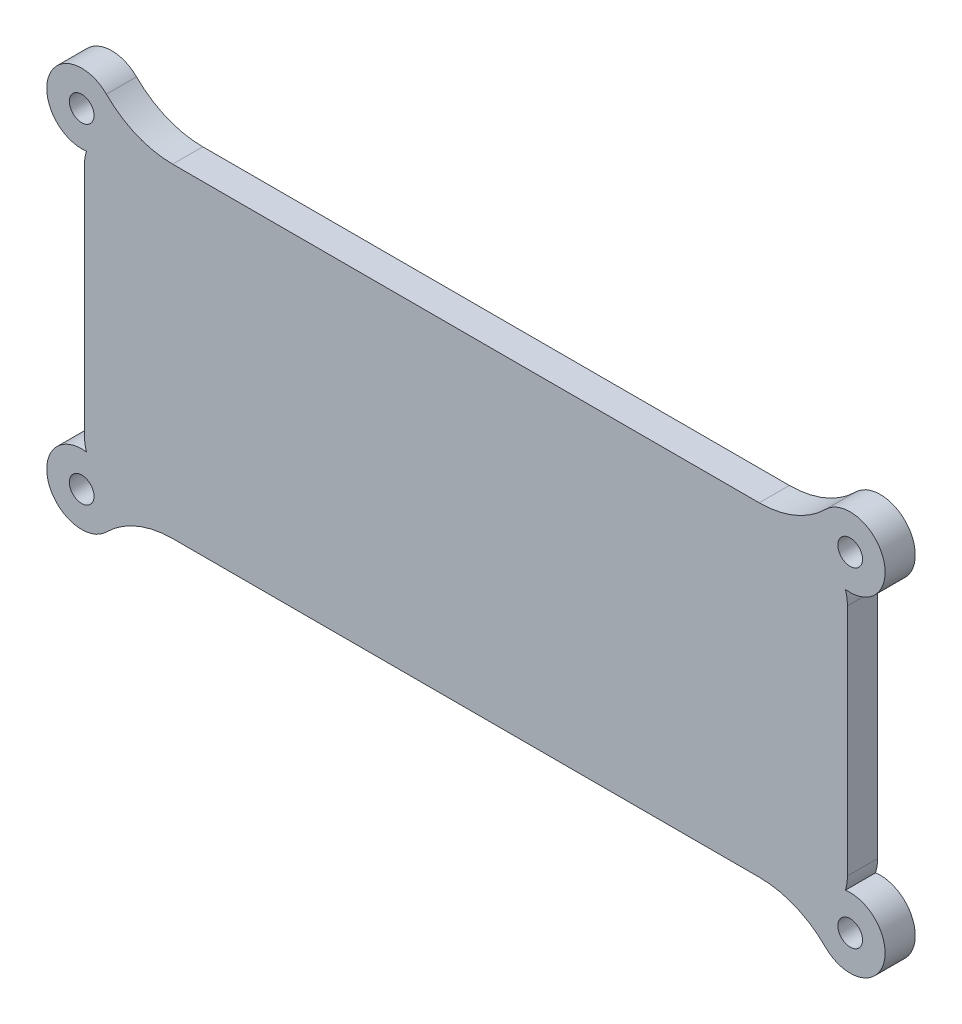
ISO-10303-21;
HEADER;
FILE_DESCRIPTION(('STEP AP214'),'2;1');
FILE_NAME('part.step','',(''),(''),'','','');
FILE_SCHEMA(('AUTOMOTIVE_DESIGN { 1 0 10303 214 1 1 1 1 }'));
ENDSEC;
DATA;
#1=APPLICATION_CONTEXT('core data for automotive mechanical design processes');
#2=APPLICATION_PROTOCOL_DEFINITION('international standard','automotive_design',2000,#1);
#3=PRODUCT_CONTEXT('',#1,'mechanical');
#4=PRODUCT('Part','Part','',(#3));
#5=PRODUCT_RELATED_PRODUCT_CATEGORY('part','',(#4));
#6=PRODUCT_DEFINITION_FORMATION('','',#4);
#7=PRODUCT_DEFINITION_CONTEXT('part definition',#1,'design');
#8=PRODUCT_DEFINITION('design','',#6,#7);
#9=PRODUCT_DEFINITION_SHAPE('','',#8);
#10=(LENGTH_UNIT() NAMED_UNIT(*) SI_UNIT(.MILLI.,.METRE.));
#11=(NAMED_UNIT(*) PLANE_ANGLE_UNIT() SI_UNIT($,.RADIAN.));
#12=(NAMED_UNIT(*) SI_UNIT($,.STERADIAN.) SOLID_ANGLE_UNIT());
#13=UNCERTAINTY_MEASURE_WITH_UNIT(LENGTH_MEASURE(1.E-05),#10,'distance_accuracy_value','');
#14=(GEOMETRIC_REPRESENTATION_CONTEXT(3) GLOBAL_UNCERTAINTY_ASSIGNED_CONTEXT((#13)) GLOBAL_UNIT_ASSIGNED_CONTEXT((#10,
#11,#12)) REPRESENTATION_CONTEXT('',''));
#15=CARTESIAN_POINT('',(0.,0.,0.));
#16=DIRECTION('',(0.,0.,1.));
#17=DIRECTION('',(1.,0.,0.));
#18=AXIS2_PLACEMENT_3D('',#15,#16,#17);
#19=CARTESIAN_POINT('',(-13.8053992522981,53.2126493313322,0.));
#20=DIRECTION('',(0.,0.,1.));
#21=DIRECTION('',(1.,0.,0.));
#22=AXIS2_PLACEMENT_3D('',#19,#20,#21);
#23=PLANE('',#22);
#24=CARTESIAN_POINT('',(-26.2752289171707,10.0580179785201,0.));
#25=DIRECTION('',(0.,0.,1.));
#26=DIRECTION('',(1.,0.,0.));
#27=AXIS2_PLACEMENT_3D('',#24,#25,#26);
#28=CIRCLE('',#27,4.5);
#29=CARTESIAN_POINT('',(-21.7752289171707,10.0580179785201,0.));
#30=VERTEX_POINT('',#29);
#31=EDGE_CURVE('E11',#30,#30,#28,.F.);
#32=ORIENTED_EDGE('',*,*,#31,.F.);
#33=EDGE_LOOP('',(#32));
#34=FACE_BOUND('',#33,.T.);
#35=CARTESIAN_POINT('',(-128.098699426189,37.8702484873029,0.));
#36=DIRECTION('',(0.,0.,1.));
#37=DIRECTION('',(1.,0.,0.));
#38=AXIS2_PLACEMENT_3D('',#35,#36,#37);
#39=CIRCLE('',#38,2.08280000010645);
#40=CARTESIAN_POINT('',(-126.015899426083,37.8702484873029,0.));
#41=VERTEX_POINT('',#40);
#42=EDGE_CURVE('E238',#41,#41,#39,.T.);
#43=ORIENTED_EDGE('',*,*,#42,.T.);
#44=EDGE_LOOP('',(#43));
#45=FACE_BOUND('',#44,.T.);
#46=CARTESIAN_POINT('',(-128.098699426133,-17.7542125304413,0.));
#47=DIRECTION('',(0.,0.,1.));
#48=DIRECTION('',(1.,0.,0.));
#49=AXIS2_PLACEMENT_3D('',#46,#47,#48);
#50=CIRCLE('',#49,2.08279999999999);
#51=CARTESIAN_POINT('',(-126.015899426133,-17.7542125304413,0.));
#52=VERTEX_POINT('',#51);
#53=EDGE_CURVE('E248',#52,#52,#50,.T.);
#54=ORIENTED_EDGE('',*,*,#53,.T.);
#55=EDGE_LOOP('',(#54));
#56=FACE_BOUND('',#55,.T.);
#57=CARTESIAN_POINT('',(1.53700159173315,37.8702484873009,0.));
#58=DIRECTION('',(0.,0.,1.));
#59=DIRECTION('',(1.,0.,0.));
#60=AXIS2_PLACEMENT_3D('',#57,#58,#59);
#61=CIRCLE('',#60,2.08280000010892);
#62=CARTESIAN_POINT('',(3.61980159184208,37.8702484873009,0.));
#63=VERTEX_POINT('',#62);
#64=EDGE_CURVE('E253',#63,#63,#61,.T.);
#65=ORIENTED_EDGE('',*,*,#64,.T.);
#66=EDGE_LOOP('',(#65));
#67=FACE_BOUND('',#66,.T.);
#68=CARTESIAN_POINT('',(1.53700159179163,-17.7542125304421,0.));
#69=DIRECTION('',(0.,0.,1.));
#70=DIRECTION('',(1.,0.,0.));
#71=AXIS2_PLACEMENT_3D('',#68,#69,#70);
#72=CIRCLE('',#71,2.08279999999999);
#73=CARTESIAN_POINT('',(3.61980159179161,-17.7542125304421,0.));
#74=VERTEX_POINT('',#73);
#75=EDGE_CURVE('E259',#74,#74,#72,.T.);
#76=ORIENTED_EDGE('',*,*,#75,.T.);
#77=EDGE_LOOP('',(#76));
#78=FACE_BOUND('',#77,.T.);
#79=CARTESIAN_POINT('',(-13.8053992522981,53.2126493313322,0.));
#80=DIRECTION('',(0.,0.,-1.));
#81=DIRECTION('',(1.,0.,0.));
#82=AXIS2_PLACEMENT_3D('',#79,#80,#81);
#83=CIRCLE('',#82,15.8046313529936);
#84=CARTESIAN_POINT('',(-2.62983724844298,42.037087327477,0.));
#85=VERTEX_POINT('',#84);
#86=CARTESIAN_POINT('',(-13.8053992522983,37.4080179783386,0.));
#87=VERTEX_POINT('',#86);
#88=EDGE_CURVE('E265',#85,#87,#83,.T.);
#89=ORIENTED_EDGE('',*,*,#88,.F.);
#90=CARTESIAN_POINT('',(1.53700159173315,37.8702484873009,0.));
#91=DIRECTION('',(0.,0.,1.));
#92=DIRECTION('',(1.,0.,0.));
#93=AXIS2_PLACEMENT_3D('',#90,#91,#92);
#94=CIRCLE('',#93,5.89280000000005);
#95=CARTESIAN_POINT('',(0.736925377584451,32.03201503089,0.));
#96=VERTEX_POINT('',#95);
#97=EDGE_CURVE('E272',#96,#85,#94,.T.);
#98=ORIENTED_EDGE('',*,*,#97,.F.);
#99=CARTESIAN_POINT('',(1.07477108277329,29.7880179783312,0.));
#100=CARTESIAN_POINT('',(1.07476896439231,30.8298968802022,0.));
#101=CARTESIAN_POINT('',(0.794869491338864,31.8343376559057,0.));
#102=CARTESIAN_POINT('',(0.767178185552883,31.9337100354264,0.));
#103=CARTESIAN_POINT('',(0.736925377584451,32.03201503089,0.));
#104=B_SPLINE_CURVE_WITH_KNOTS('',2,(#99,#100,#101,#102,#103),.UNSPECIFIED.,.F.,.F.,(3,2,3),(0.,
0.25,0.275715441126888),.UNSPECIFIED.);
#105=CARTESIAN_POINT('',(1.07477108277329,29.7880179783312,0.));
#106=VERTEX_POINT('',#105);
#107=EDGE_CURVE('E632',#106,#96,#104,.T.);
#108=ORIENTED_EDGE('',*,*,#107,.F.);
#109=DIRECTION('',(0.,1.,0.));
#110=VECTOR('',#109,1.);
#111=CARTESIAN_POINT('',(1.07477108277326,-9.67198202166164,0.));
#112=LINE('',#111,#110);
#113=CARTESIAN_POINT('',(1.07477108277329,-9.67198202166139,0.));
#114=VERTEX_POINT('',#113);
#115=EDGE_CURVE('E473',#114,#106,#112,.T.);
#116=ORIENTED_EDGE('',*,*,#115,.F.);
#117=CARTESIAN_POINT('',(0.736871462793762,-11.915986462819,0.));
#118=CARTESIAN_POINT('',(0.824350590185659,-11.6321245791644,0.));
#119=CARTESIAN_POINT('',(1.00171403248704,-10.9098310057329,0.));
#120=CARTESIAN_POINT('',(1.07477068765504,-10.145005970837,0.));
#121=CARTESIAN_POINT('',(1.07477108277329,-9.67198202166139,0.));
#122=B_SPLINE_CURVE_WITH_KNOTS('',3,(#117,#118,#119,#120,#121),.UNSPECIFIED.,.F.,.F.,(4,1,4),
(0.0113006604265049,0.015257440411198,0.0211260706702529),.UNSPECIFIED.);
#123=CARTESIAN_POINT('',(0.736871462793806,-11.9159864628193,0.));
#124=VERTEX_POINT('',#123);
#125=EDGE_CURVE('E466',#124,#114,#122,.T.);
#126=ORIENTED_EDGE('',*,*,#125,.F.);
#127=CARTESIAN_POINT('',(1.53700159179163,-17.7542125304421,0.));
#128=DIRECTION('',(0.,0.,1.));
#129=DIRECTION('',(1.,0.,0.));
#130=AXIS2_PLACEMENT_3D('',#127,#128,#129);
#131=CIRCLE('',#130,5.89280000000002);
#132=CARTESIAN_POINT('',(-2.62983724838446,-21.9210513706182,0.));
#133=VERTEX_POINT('',#132);
#134=EDGE_CURVE('E465',#133,#124,#131,.T.);
#135=ORIENTED_EDGE('',*,*,#134,.F.);
#136=CARTESIAN_POINT('',(-13.8053992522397,-33.0966133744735,0.));
#137=DIRECTION('',(0.,0.,-1.));
#138=DIRECTION('',(1.,0.,0.));
#139=AXIS2_PLACEMENT_3D('',#136,#137,#138);
#140=CIRCLE('',#139,15.8046313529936);
#141=CARTESIAN_POINT('',(-13.8053992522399,-17.2919820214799,0.));
#142=VERTEX_POINT('',#141);
#143=EDGE_CURVE('E467',#142,#133,#140,.T.);
#144=ORIENTED_EDGE('',*,*,#143,.F.);
#145=DIRECTION('',(1.,0.,0.));
#146=VECTOR('',#145,1.);
#147=CARTESIAN_POINT('',(-112.756298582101,-17.2919820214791,0.));
#148=LINE('',#147,#146);
#149=CARTESIAN_POINT('',(-112.756298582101,-17.2919820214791,0.));
#150=VERTEX_POINT('',#149);
#151=EDGE_CURVE('E474',#150,#142,#148,.T.);
#152=ORIENTED_EDGE('',*,*,#151,.F.);
#153=CARTESIAN_POINT('',(-112.756298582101,-33.0966133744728,0.));
#154=DIRECTION('',(0.,0.,-1.));
#155=DIRECTION('',(1.,0.,0.));
#156=AXIS2_PLACEMENT_3D('',#153,#154,#155);
#157=CIRCLE('',#156,15.8046313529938);
#158=CARTESIAN_POINT('',(-123.931860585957,-21.9210513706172,0.));
#159=VERTEX_POINT('',#158);
#160=EDGE_CURVE('E374',#159,#150,#157,.T.);
#161=ORIENTED_EDGE('',*,*,#160,.F.);
#162=CARTESIAN_POINT('',(-128.098699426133,-17.7542125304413,0.));
#163=DIRECTION('',(0.,0.,1.));
#164=DIRECTION('',(1.,0.,0.));
#165=AXIS2_PLACEMENT_3D('',#162,#163,#164);
#166=CIRCLE('',#165,5.89279999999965);
#167=CARTESIAN_POINT('',(-127.298623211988,-11.9159790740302,0.));
#168=VERTEX_POINT('',#167);
#169=EDGE_CURVE('E372',#168,#159,#166,.T.);
#170=ORIENTED_EDGE('',*,*,#169,.F.);
#171=CARTESIAN_POINT('',(-127.636468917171,-9.67198202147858,0.));
#172=CARTESIAN_POINT('',(-127.636466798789,-10.713860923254,0.));
#173=CARTESIAN_POINT('',(-127.356567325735,-11.7183016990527,0.));
#174=CARTESIAN_POINT('',(-127.328876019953,-11.8176740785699,0.));
#175=CARTESIAN_POINT('',(-127.298623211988,-11.9159790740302,0.));
#176=B_SPLINE_CURVE_WITH_KNOTS('',2,(#171,#172,#173,#174,#175),.UNSPECIFIED.,.F.,.F.,(3,2,3),
(0.,0.25,0.275715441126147),.UNSPECIFIED.);
#177=CARTESIAN_POINT('',(-127.636468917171,-9.67198202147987,0.));
#178=VERTEX_POINT('',#177);
#179=EDGE_CURVE('E369',#178,#168,#176,.T.);
#180=ORIENTED_EDGE('',*,*,#179,.F.);
#181=DIRECTION('',(0.,-1.,0.));
#182=VECTOR('',#181,1.);
#183=CARTESIAN_POINT('',(-127.636468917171,-9.67198202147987,0.));
#184=LINE('',#183,#182);
#185=CARTESIAN_POINT('',(-127.636468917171,29.78801797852,0.));
#186=VERTEX_POINT('',#185);
#187=EDGE_CURVE('E362',#186,#178,#184,.T.);
#188=ORIENTED_EDGE('',*,*,#187,.F.);
#189=CARTESIAN_POINT('',(-127.298569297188,32.0320224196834,0.));
#190=CARTESIAN_POINT('',(-127.386048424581,31.7481605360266,0.));
#191=CARTESIAN_POINT('',(-127.563411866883,31.0258669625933,0.));
#192=CARTESIAN_POINT('',(-127.636468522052,30.2610419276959,0.));
#193=CARTESIAN_POINT('',(-127.636468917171,29.78801797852,0.));
#194=B_SPLINE_CURVE_WITH_KNOTS('',3,(#189,#190,#191,#192,#193),.UNSPECIFIED.,.F.,.F.,(4,1,4),
(0.511300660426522,0.515257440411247,0.521126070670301),.UNSPECIFIED.);
#195=CARTESIAN_POINT('',(-127.298569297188,32.0320224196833,0.));
#196=VERTEX_POINT('',#195);
#197=EDGE_CURVE('E321',#196,#186,#194,.T.);
#198=ORIENTED_EDGE('',*,*,#197,.F.);
#199=CARTESIAN_POINT('',(-128.098699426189,37.8702484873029,0.));
#200=DIRECTION('',(0.,0.,1.));
#201=DIRECTION('',(1.,0.,0.));
#202=AXIS2_PLACEMENT_3D('',#199,#200,#201);
#203=CIRCLE('',#202,5.89279999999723);
#204=CARTESIAN_POINT('',(-123.931860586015,42.037087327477,0.));
#205=VERTEX_POINT('',#204);
#206=EDGE_CURVE('E326',#205,#196,#203,.T.);
#207=ORIENTED_EDGE('',*,*,#206,.F.);
#208=CARTESIAN_POINT('',(-112.75629858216,53.2126493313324,0.));
#209=DIRECTION('',(0.,0.,-1.));
#210=DIRECTION('',(1.,0.,0.));
#211=AXIS2_PLACEMENT_3D('',#208,#209,#210);
#212=CIRCLE('',#211,15.8046313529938);
#213=CARTESIAN_POINT('',(-112.75629858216,37.4080179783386,0.));
#214=VERTEX_POINT('',#213);
#215=EDGE_CURVE('E554',#214,#205,#212,.T.);
#216=ORIENTED_EDGE('',*,*,#215,.F.);
#217=DIRECTION('',(-1.,0.,0.));
#218=VECTOR('',#217,1.);
#219=CARTESIAN_POINT('',(-13.8053992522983,37.4080179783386,0.));
#220=LINE('',#219,#218);
#221=EDGE_CURVE('E552',#87,#214,#220,.T.);
#222=ORIENTED_EDGE('',*,*,#221,.F.);
#223=EDGE_LOOP('',(#89,#98,#108,#116,#126,#135,#144,#152,#161,#170,#180,#188,#198,#207,#216,#222));
#224=FACE_BOUND('',#223,.T.);
#225=DIRECTION('',(-1.,0.,0.));
#226=VECTOR('',#225,1.);
#227=CARTESIAN_POINT('',(-53.6252289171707,15.1380179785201,0.));
#228=LINE('',#227,#226);
#229=CARTESIAN_POINT('',(-53.6252289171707,15.1380179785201,0.));
#230=VERTEX_POINT('',#229);
#231=CARTESIAN_POINT('',(-54.8952289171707,15.1380179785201,0.));
#232=VERTEX_POINT('',#231);
#233=EDGE_CURVE('E237',#230,#232,#228,.T.);
#234=ORIENTED_EDGE('',*,*,#233,.F.);
#235=DIRECTION('',(0.,-1.,0.));
#236=VECTOR('',#235,1.);
#237=CARTESIAN_POINT('',(-53.6252289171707,15.1380179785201,0.));
#238=LINE('',#237,#236);
#239=CARTESIAN_POINT('',(-53.6252289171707,31.0580179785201,0.));
#240=VERTEX_POINT('',#239);
#241=EDGE_CURVE('E234',#240,#230,#238,.T.);
#242=ORIENTED_EDGE('',*,*,#241,.F.);
#243=DIRECTION('',(1.,0.,0.));
#244=VECTOR('',#243,1.);
#245=CARTESIAN_POINT('',(-53.6252289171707,31.0580179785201,0.));
#246=LINE('',#245,#244);
#247=CARTESIAN_POINT('',(-121.286468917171,31.0580179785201,0.));
#248=VERTEX_POINT('',#247);
#249=EDGE_CURVE('E1042',#248,#240,#246,.T.);
#250=ORIENTED_EDGE('',*,*,#249,.F.);
#251=DIRECTION('',(0.,1.,0.));
#252=VECTOR('',#251,1.);
#253=CARTESIAN_POINT('',(-121.286468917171,31.0580179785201,0.));
#254=LINE('',#253,#252);
#255=CARTESIAN_POINT('',(-121.286468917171,-10.9419820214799,0.));
#256=VERTEX_POINT('',#255);
#257=EDGE_CURVE('E1039',#256,#248,#254,.T.);
#258=ORIENTED_EDGE('',*,*,#257,.F.);
#259=DIRECTION('',(-1.,0.,0.));
#260=VECTOR('',#259,1.);
#261=CARTESIAN_POINT('',(-121.286468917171,-10.9419820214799,0.));
#262=LINE('',#261,#260);
#263=CARTESIAN_POINT('',(-53.6252289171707,-10.9419820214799,0.));
#264=VERTEX_POINT('',#263);
#265=EDGE_CURVE('E1036',#264,#256,#262,.T.);
#266=ORIENTED_EDGE('',*,*,#265,.F.);
#267=DIRECTION('',(0.,-1.,0.));
#268=VECTOR('',#267,1.);
#269=CARTESIAN_POINT('',(-53.6252289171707,-10.9419820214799,0.));
#270=LINE('',#269,#268);
#271=CARTESIAN_POINT('',(-53.6252289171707,4.97801797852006,0.));
#272=VERTEX_POINT('',#271);
#273=EDGE_CURVE('E1033',#272,#264,#270,.T.);
#274=ORIENTED_EDGE('',*,*,#273,.F.);
#275=DIRECTION('',(1.,0.,0.));
#276=VECTOR('',#275,1.);
#277=CARTESIAN_POINT('',(-53.6252289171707,4.97801797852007,0.));
#278=LINE('',#277,#276);
#279=CARTESIAN_POINT('',(-54.8952289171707,4.97801797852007,0.));
#280=VERTEX_POINT('',#279);
#281=EDGE_CURVE('E1030',#280,#272,#278,.T.);
#282=ORIENTED_EDGE('',*,*,#281,.F.);
#283=DIRECTION('',(0.,1.,0.));
#284=VECTOR('',#283,1.);
#285=CARTESIAN_POINT('',(-54.8952289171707,-9.67198202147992,0.));
#286=LINE('',#285,#284);
#287=CARTESIAN_POINT('',(-54.8952289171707,-9.67198202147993,0.));
#288=VERTEX_POINT('',#287);
#289=EDGE_CURVE('E1027',#288,#280,#286,.T.);
#290=ORIENTED_EDGE('',*,*,#289,.F.);
#291=DIRECTION('',(1.,0.,0.));
#292=VECTOR('',#291,1.);
#293=CARTESIAN_POINT('',(-120.016468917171,-9.67198202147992,0.));
#294=LINE('',#293,#292);
#295=CARTESIAN_POINT('',(-120.016468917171,-9.67198202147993,0.));
#296=VERTEX_POINT('',#295);
#297=EDGE_CURVE('E1024',#296,#288,#294,.T.);
#298=ORIENTED_EDGE('',*,*,#297,.F.);
#299=DIRECTION('',(0.,-1.,0.));
#300=VECTOR('',#299,1.);
#301=CARTESIAN_POINT('',(-120.016468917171,29.7880179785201,0.));
#302=LINE('',#301,#300);
#303=CARTESIAN_POINT('',(-120.016468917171,29.7880179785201,0.));
#304=VERTEX_POINT('',#303);
#305=EDGE_CURVE('E1021',#304,#296,#302,.T.);
#306=ORIENTED_EDGE('',*,*,#305,.F.);
#307=DIRECTION('',(-1.,0.,0.));
#308=VECTOR('',#307,1.);
#309=CARTESIAN_POINT('',(-54.8952289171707,29.7880179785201,0.));
#310=LINE('',#309,#308);
#311=CARTESIAN_POINT('',(-54.8952289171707,29.7880179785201,0.));
#312=VERTEX_POINT('',#311);
#313=EDGE_CURVE('E52',#312,#304,#310,.T.);
#314=ORIENTED_EDGE('',*,*,#313,.F.);
#315=DIRECTION('',(0.,1.,0.));
#316=VECTOR('',#315,1.);
#317=CARTESIAN_POINT('',(-54.8952289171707,15.1380179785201,0.));
#318=LINE('',#317,#316);
#319=EDGE_CURVE('E47',#232,#312,#318,.T.);
#320=ORIENTED_EDGE('',*,*,#319,.F.);
#321=EDGE_LOOP('',(#234,#242,#250,#258,#266,#274,#282,#290,#298,#306,#314,#320));
#322=FACE_BOUND('',#321,.T.);
#323=ADVANCED_FACE('F32',(#34,#45,#56,#67,#78,#224,#322),#23,.F.);
#324=CARTESIAN_POINT('',(-13.8053992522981,53.2126493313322,5.08));
#325=DIRECTION('',(0.,0.,1.));
#326=DIRECTION('',(1.,0.,0.));
#327=AXIS2_PLACEMENT_3D('',#324,#325,#326);
#328=PLANE('',#327);
#329=CARTESIAN_POINT('',(-128.098699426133,-17.7542125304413,5.08));
#330=DIRECTION('',(0.,0.,1.));
#331=DIRECTION('',(1.,0.,0.));
#332=AXIS2_PLACEMENT_3D('',#329,#330,#331);
#333=CIRCLE('',#332,2.08279999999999);
#334=CARTESIAN_POINT('',(-126.015899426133,-17.7542125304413,5.08));
#335=VERTEX_POINT('',#334);
#336=EDGE_CURVE('E250',#335,#335,#333,.T.);
#337=ORIENTED_EDGE('',*,*,#336,.F.);
#338=EDGE_LOOP('',(#337));
#339=FACE_BOUND('',#338,.T.);
#340=CARTESIAN_POINT('',(1.53700159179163,-17.7542125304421,5.08));
#341=DIRECTION('',(0.,0.,1.));
#342=DIRECTION('',(1.,0.,0.));
#343=AXIS2_PLACEMENT_3D('',#340,#341,#342);
#344=CIRCLE('',#343,2.08279999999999);
#345=CARTESIAN_POINT('',(3.61980159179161,-17.7542125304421,5.08));
#346=VERTEX_POINT('',#345);
#347=EDGE_CURVE('E262',#346,#346,#344,.T.);
#348=ORIENTED_EDGE('',*,*,#347,.F.);
#349=EDGE_LOOP('',(#348));
#350=FACE_BOUND('',#349,.T.);
#351=CARTESIAN_POINT('',(-13.8053992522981,53.2126493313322,5.08));
#352=DIRECTION('',(0.,0.,-1.));
#353=DIRECTION('',(1.,0.,0.));
#354=AXIS2_PLACEMENT_3D('',#351,#352,#353);
#355=CIRCLE('',#354,15.8046313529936);
#356=CARTESIAN_POINT('',(-2.62983724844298,42.037087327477,5.08));
#357=VERTEX_POINT('',#356);
#358=CARTESIAN_POINT('',(-13.8053992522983,37.4080179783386,5.08));
#359=VERTEX_POINT('',#358);
#360=EDGE_CURVE('E268',#357,#359,#355,.T.);
#361=ORIENTED_EDGE('',*,*,#360,.T.);
#362=DIRECTION('',(-1.,0.,0.));
#363=VECTOR('',#362,1.);
#364=CARTESIAN_POINT('',(-13.8053992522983,37.4080179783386,5.08));
#365=LINE('',#364,#363);
#366=CARTESIAN_POINT('',(-112.75629858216,37.4080179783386,5.08));
#367=VERTEX_POINT('',#366);
#368=EDGE_CURVE('E271',#359,#367,#365,.T.);
#369=ORIENTED_EDGE('',*,*,#368,.T.);
#370=CARTESIAN_POINT('',(-112.75629858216,53.2126493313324,5.08));
#371=DIRECTION('',(0.,0.,-1.));
#372=DIRECTION('',(1.,0.,0.));
#373=AXIS2_PLACEMENT_3D('',#370,#371,#372);
#374=CIRCLE('',#373,15.8046313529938);
#375=CARTESIAN_POINT('',(-123.931860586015,42.037087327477,5.08));
#376=VERTEX_POINT('',#375);
#377=EDGE_CURVE('E274',#367,#376,#374,.T.);
#378=ORIENTED_EDGE('',*,*,#377,.T.);
#379=CARTESIAN_POINT('',(-128.098699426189,37.8702484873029,5.08));
#380=DIRECTION('',(0.,0.,1.));
#381=DIRECTION('',(1.,0.,0.));
#382=AXIS2_PLACEMENT_3D('',#379,#380,#381);
#383=CIRCLE('',#382,5.89279999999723);
#384=CARTESIAN_POINT('',(-127.298569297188,32.0320224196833,5.08));
#385=VERTEX_POINT('',#384);
#386=EDGE_CURVE('E276',#376,#385,#383,.T.);
#387=ORIENTED_EDGE('',*,*,#386,.T.);
#388=CARTESIAN_POINT('',(-127.636468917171,29.78801797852,5.08));
#389=CARTESIAN_POINT('',(-127.636468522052,30.2610419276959,5.08));
#390=CARTESIAN_POINT('',(-127.563411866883,31.0258669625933,5.08));
#391=CARTESIAN_POINT('',(-127.386048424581,31.7481605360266,5.08));
#392=CARTESIAN_POINT('',(-127.298569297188,32.0320224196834,5.08));
#393=B_SPLINE_CURVE_WITH_KNOTS('',3,(#388,#389,#390,#391,#392),.UNSPECIFIED.,.F.,.F.,(4,1,4),
(0.511300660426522,0.517169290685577,0.521126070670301),.UNSPECIFIED.);
#394=CARTESIAN_POINT('',(-127.636468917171,29.78801797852,5.08));
#395=VERTEX_POINT('',#394);
#396=EDGE_CURVE('E380',#385,#395,#393,.F.);
#397=ORIENTED_EDGE('',*,*,#396,.T.);
#398=DIRECTION('',(0.,-1.,0.));
#399=VECTOR('',#398,1.);
#400=CARTESIAN_POINT('',(-127.636468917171,-9.67198202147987,5.08));
#401=LINE('',#400,#399);
#402=CARTESIAN_POINT('',(-127.636468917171,-9.67198202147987,5.08));
#403=VERTEX_POINT('',#402);
#404=EDGE_CURVE('E395',#395,#403,#401,.T.);
#405=ORIENTED_EDGE('',*,*,#404,.T.);
#406=CARTESIAN_POINT('',(-127.298623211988,-11.9159790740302,5.08));
#407=CARTESIAN_POINT('',(-127.328876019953,-11.8176740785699,5.08));
#408=CARTESIAN_POINT('',(-127.356567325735,-11.7183016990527,5.08));
#409=CARTESIAN_POINT('',(-127.636466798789,-10.713860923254,5.08));
#410=CARTESIAN_POINT('',(-127.636468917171,-9.67198202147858,5.08));
#411=B_SPLINE_CURVE_WITH_KNOTS('',2,(#406,#407,#408,#409,#410),.UNSPECIFIED.,.F.,.F.,(3,2,3),
(0.,0.0257154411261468,0.275715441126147),.UNSPECIFIED.);
#412=CARTESIAN_POINT('',(-127.298623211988,-11.9159790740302,5.08));
#413=VERTEX_POINT('',#412);
#414=EDGE_CURVE('E396',#403,#413,#411,.F.);
#415=ORIENTED_EDGE('',*,*,#414,.T.);
#416=CARTESIAN_POINT('',(-128.098699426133,-17.7542125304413,5.08));
#417=DIRECTION('',(0.,0.,1.));
#418=DIRECTION('',(1.,0.,0.));
#419=AXIS2_PLACEMENT_3D('',#416,#417,#418);
#420=CIRCLE('',#419,5.89279999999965);
#421=CARTESIAN_POINT('',(-123.931860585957,-21.9210513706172,5.08));
#422=VERTEX_POINT('',#421);
#423=EDGE_CURVE('E425',#413,#422,#420,.T.);
#424=ORIENTED_EDGE('',*,*,#423,.T.);
#425=CARTESIAN_POINT('',(-112.756298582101,-33.0966133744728,5.08));
#426=DIRECTION('',(0.,0.,-1.));
#427=DIRECTION('',(1.,0.,0.));
#428=AXIS2_PLACEMENT_3D('',#425,#426,#427);
#429=CIRCLE('',#428,15.8046313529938);
#430=CARTESIAN_POINT('',(-112.756298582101,-17.2919820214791,5.08));
#431=VERTEX_POINT('',#430);
#432=EDGE_CURVE('E427',#422,#431,#429,.T.);
#433=ORIENTED_EDGE('',*,*,#432,.T.);
#434=DIRECTION('',(1.,0.,0.));
#435=VECTOR('',#434,1.);
#436=CARTESIAN_POINT('',(-112.756298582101,-17.2919820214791,5.08));
#437=LINE('',#436,#435);
#438=CARTESIAN_POINT('',(-13.8053992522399,-17.2919820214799,5.08));
#439=VERTEX_POINT('',#438);
#440=EDGE_CURVE('E567',#431,#439,#437,.T.);
#441=ORIENTED_EDGE('',*,*,#440,.T.);
#442=CARTESIAN_POINT('',(-13.8053992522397,-33.0966133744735,5.08));
#443=DIRECTION('',(0.,0.,-1.));
#444=DIRECTION('',(1.,0.,0.));
#445=AXIS2_PLACEMENT_3D('',#442,#443,#444);
#446=CIRCLE('',#445,15.8046313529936);
#447=CARTESIAN_POINT('',(-2.62983724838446,-21.9210513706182,5.08));
#448=VERTEX_POINT('',#447);
#449=EDGE_CURVE('E607',#439,#448,#446,.T.);
#450=ORIENTED_EDGE('',*,*,#449,.T.);
#451=CARTESIAN_POINT('',(1.53700159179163,-17.7542125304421,5.08));
#452=DIRECTION('',(0.,0.,1.));
#453=DIRECTION('',(1.,0.,0.));
#454=AXIS2_PLACEMENT_3D('',#451,#452,#453);
#455=CIRCLE('',#454,5.89280000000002);
#456=CARTESIAN_POINT('',(0.736871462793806,-11.9159864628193,5.08));
#457=VERTEX_POINT('',#456);
#458=EDGE_CURVE('E599',#448,#457,#455,.T.);
#459=ORIENTED_EDGE('',*,*,#458,.T.);
#460=CARTESIAN_POINT('',(1.07477108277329,-9.67198202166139,5.08));
#461=CARTESIAN_POINT('',(1.07477068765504,-10.145005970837,5.08));
#462=CARTESIAN_POINT('',(1.00171403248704,-10.9098310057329,5.08));
#463=CARTESIAN_POINT('',(0.824350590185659,-11.6321245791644,5.08));
#464=CARTESIAN_POINT('',(0.736871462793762,-11.915986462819,5.08));
#465=B_SPLINE_CURVE_WITH_KNOTS('',3,(#460,#461,#462,#463,#464),.UNSPECIFIED.,.F.,.F.,(4,1,4),
(0.0113006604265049,0.0171692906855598,0.0211260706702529),.UNSPECIFIED.);
#466=CARTESIAN_POINT('',(1.07477108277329,-9.67198202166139,5.08));
#467=VERTEX_POINT('',#466);
#468=EDGE_CURVE('E606',#457,#467,#465,.F.);
#469=ORIENTED_EDGE('',*,*,#468,.T.);
#470=DIRECTION('',(0.,1.,0.));
#471=VECTOR('',#470,1.);
#472=CARTESIAN_POINT('',(1.07477108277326,-9.67198202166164,5.08));
#473=LINE('',#472,#471);
#474=CARTESIAN_POINT('',(1.07477108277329,29.7880179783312,5.08));
#475=VERTEX_POINT('',#474);
#476=EDGE_CURVE('E523',#467,#475,#473,.T.);
#477=ORIENTED_EDGE('',*,*,#476,.T.);
#478=CARTESIAN_POINT('',(0.736925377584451,32.03201503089,5.08));
#479=CARTESIAN_POINT('',(0.767178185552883,31.9337100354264,5.08));
#480=CARTESIAN_POINT('',(0.794869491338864,31.8343376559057,5.08));
#481=CARTESIAN_POINT('',(1.07476896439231,30.8298968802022,5.08));
#482=CARTESIAN_POINT('',(1.07477108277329,29.7880179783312,5.08));
#483=B_SPLINE_CURVE_WITH_KNOTS('',2,(#478,#479,#480,#481,#482),.UNSPECIFIED.,.F.,.F.,(3,2,3),
(0.,0.025715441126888,0.275715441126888),.UNSPECIFIED.);
#484=CARTESIAN_POINT('',(0.736925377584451,32.03201503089,5.08));
#485=VERTEX_POINT('',#484);
#486=EDGE_CURVE('E507',#475,#485,#483,.F.);
#487=ORIENTED_EDGE('',*,*,#486,.T.);
#488=CARTESIAN_POINT('',(1.53700159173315,37.8702484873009,5.08));
#489=DIRECTION('',(0.,0.,1.));
#490=DIRECTION('',(1.,0.,0.));
#491=AXIS2_PLACEMENT_3D('',#488,#489,#490);
#492=CIRCLE('',#491,5.89280000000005);
#493=EDGE_CURVE('E487',#485,#357,#492,.T.);
#494=ORIENTED_EDGE('',*,*,#493,.T.);
#495=EDGE_LOOP('',(#361,#369,#378,#387,#397,#405,#415,#424,#433,#441,#450,#459,#469,#477,#487,#494));
#496=FACE_BOUND('',#495,.T.);
#497=CARTESIAN_POINT('',(1.53700159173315,37.8702484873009,5.08));
#498=DIRECTION('',(0.,0.,1.));
#499=DIRECTION('',(1.,0.,0.));
#500=AXIS2_PLACEMENT_3D('',#497,#498,#499);
#501=CIRCLE('',#500,2.08280000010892);
#502=CARTESIAN_POINT('',(3.61980159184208,37.8702484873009,5.08));
#503=VERTEX_POINT('',#502);
#504=EDGE_CURVE('E256',#503,#503,#501,.T.);
#505=ORIENTED_EDGE('',*,*,#504,.F.);
#506=EDGE_LOOP('',(#505));
#507=FACE_BOUND('',#506,.T.);
#508=CARTESIAN_POINT('',(-128.098699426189,37.8702484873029,5.08));
#509=DIRECTION('',(0.,0.,1.));
#510=DIRECTION('',(1.,0.,0.));
#511=AXIS2_PLACEMENT_3D('',#508,#509,#510);
#512=CIRCLE('',#511,2.08280000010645);
#513=CARTESIAN_POINT('',(-126.015899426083,37.8702484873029,5.08));
#514=VERTEX_POINT('',#513);
#515=EDGE_CURVE('E241',#514,#514,#512,.T.);
#516=ORIENTED_EDGE('',*,*,#515,.F.);
#517=EDGE_LOOP('',(#516));
#518=FACE_BOUND('',#517,.T.);
#519=ADVANCED_FACE('F336',(#339,#350,#496,#507,#518),#328,.T.);
#520=CARTESIAN_POINT('',(-13.8053992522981,53.2126493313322,5.08));
#521=DIRECTION('',(0.,0.,-1.));
#522=DIRECTION('',(-1.,0.,0.));
#523=AXIS2_PLACEMENT_3D('',#520,#521,#522);
#524=CYLINDRICAL_SURFACE('',#523,15.8046313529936);
#525=ORIENTED_EDGE('',*,*,#88,.T.);
#526=DIRECTION('',(0.,0.,-1.));
#527=VECTOR('',#526,1.);
#528=CARTESIAN_POINT('',(-13.8053992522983,37.4080179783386,5.08));
#529=LINE('',#528,#527);
#530=EDGE_CURVE('E40',#359,#87,#529,.T.);
#531=ORIENTED_EDGE('',*,*,#530,.F.);
#532=ORIENTED_EDGE('',*,*,#360,.F.);
#533=DIRECTION('',(0.,0.,-1.));
#534=VECTOR('',#533,1.);
#535=CARTESIAN_POINT('',(-2.62983724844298,42.037087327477,5.08));
#536=LINE('',#535,#534);
#537=EDGE_CURVE('E483',#357,#85,#536,.T.);
#538=ORIENTED_EDGE('',*,*,#537,.T.);
#539=EDGE_LOOP('',(#525,#531,#532,#538));
#540=FACE_BOUND('',#539,.T.);
#541=ADVANCED_FACE('F34',(#540),#524,.F.);
#542=CARTESIAN_POINT('',(-13.8053992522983,37.4080179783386,5.08));
#543=DIRECTION('',(0.,-1.,0.));
#544=DIRECTION('',(0.,0.,-1.));
#545=AXIS2_PLACEMENT_3D('',#542,#543,#544);
#546=PLANE('',#545);
#547=ORIENTED_EDGE('',*,*,#221,.T.);
#548=DIRECTION('',(0.,0.,-1.));
#549=VECTOR('',#548,1.);
#550=CARTESIAN_POINT('',(-112.75629858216,37.4080179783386,5.08));
#551=LINE('',#550,#549);
#552=EDGE_CURVE('E500',#367,#214,#551,.T.);
#553=ORIENTED_EDGE('',*,*,#552,.F.);
#554=ORIENTED_EDGE('',*,*,#368,.F.);
#555=ORIENTED_EDGE('',*,*,#530,.T.);
#556=EDGE_LOOP('',(#547,#553,#554,#555));
#557=FACE_BOUND('',#556,.T.);
#558=ADVANCED_FACE('F934',(#557),#546,.F.);
#559=CARTESIAN_POINT('',(-112.75629858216,53.2126493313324,5.08));
#560=DIRECTION('',(0.,0.,-1.));
#561=DIRECTION('',(-1.,0.,0.));
#562=AXIS2_PLACEMENT_3D('',#559,#560,#561);
#563=CYLINDRICAL_SURFACE('',#562,15.8046313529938);
#564=ORIENTED_EDGE('',*,*,#215,.T.);
#565=DIRECTION('',(0.,0.,-1.));
#566=VECTOR('',#565,1.);
#567=CARTESIAN_POINT('',(-123.931860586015,42.037087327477,5.08));
#568=LINE('',#567,#566);
#569=EDGE_CURVE('E403',#376,#205,#568,.T.);
#570=ORIENTED_EDGE('',*,*,#569,.F.);
#571=ORIENTED_EDGE('',*,*,#377,.F.);
#572=ORIENTED_EDGE('',*,*,#552,.T.);
#573=EDGE_LOOP('',(#564,#570,#571,#572));
#574=FACE_BOUND('',#573,.T.);
#575=ADVANCED_FACE('F926',(#574),#563,.F.);
#576=CARTESIAN_POINT('',(-128.098699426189,37.8702484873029,5.08));
#577=DIRECTION('',(0.,0.,-1.));
#578=DIRECTION('',(-1.,0.,0.));
#579=AXIS2_PLACEMENT_3D('',#576,#577,#578);
#580=CYLINDRICAL_SURFACE('',#579,5.89279999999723);
#581=ORIENTED_EDGE('',*,*,#206,.T.);
#582=DIRECTION('',(0.,0.,-1.));
#583=VECTOR('',#582,1.);
#584=CARTESIAN_POINT('',(-127.298569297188,32.0320224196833,5.08));
#585=LINE('',#584,#583);
#586=EDGE_CURVE('E391',#385,#196,#585,.T.);
#587=ORIENTED_EDGE('',*,*,#586,.F.);
#588=ORIENTED_EDGE('',*,*,#386,.F.);
#589=ORIENTED_EDGE('',*,*,#569,.T.);
#590=EDGE_LOOP('',(#581,#587,#588,#589));
#591=FACE_BOUND('',#590,.T.);
#592=ADVANCED_FACE('F295',(#591),#580,.T.);
#593=CARTESIAN_POINT('',(-127.298569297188,32.0320224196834,5.08));
#594=CARTESIAN_POINT('',(-127.386048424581,31.7481605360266,5.08));
#595=CARTESIAN_POINT('',(-127.563411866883,31.0258669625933,5.08));
#596=CARTESIAN_POINT('',(-127.636468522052,30.2610419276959,5.08));
#597=CARTESIAN_POINT('',(-127.636468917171,29.78801797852,5.08));
#598=B_SPLINE_CURVE_WITH_KNOTS('',3,(#593,#594,#595,#596,#597),.UNSPECIFIED.,.F.,.F.,(4,1,4),
(0.511300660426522,0.515257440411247,0.521126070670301),.UNSPECIFIED.);
#599=DIRECTION('',(0.,0.,-1.));
#600=VECTOR('',#599,1.);
#601=SURFACE_OF_LINEAR_EXTRUSION('',#598,#600);
#602=ORIENTED_EDGE('',*,*,#197,.T.);
#603=DIRECTION('',(0.,0.,-1.));
#604=VECTOR('',#603,1.);
#605=CARTESIAN_POINT('',(-127.636468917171,29.78801797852,5.08));
#606=LINE('',#605,#604);
#607=EDGE_CURVE('E393',#395,#186,#606,.T.);
#608=ORIENTED_EDGE('',*,*,#607,.F.);
#609=ORIENTED_EDGE('',*,*,#396,.F.);
#610=ORIENTED_EDGE('',*,*,#586,.T.);
#611=EDGE_LOOP('',(#602,#608,#609,#610));
#612=FACE_BOUND('',#611,.T.);
#613=ADVANCED_FACE('F289',(#612),#601,.F.);
#614=CARTESIAN_POINT('',(-127.636468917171,-9.67198202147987,5.08));
#615=DIRECTION('',(1.,0.,0.));
#616=DIRECTION('',(0.,0.,-1.));
#617=AXIS2_PLACEMENT_3D('',#614,#615,#616);
#618=PLANE('',#617);
#619=ORIENTED_EDGE('',*,*,#187,.T.);
#620=DIRECTION('',(0.,0.,-1.));
#621=VECTOR('',#620,1.);
#622=CARTESIAN_POINT('',(-127.636468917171,-9.67198202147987,5.08));
#623=LINE('',#622,#621);
#624=EDGE_CURVE('E406',#403,#178,#623,.T.);
#625=ORIENTED_EDGE('',*,*,#624,.F.);
#626=ORIENTED_EDGE('',*,*,#404,.F.);
#627=ORIENTED_EDGE('',*,*,#607,.T.);
#628=EDGE_LOOP('',(#619,#625,#626,#627));
#629=FACE_BOUND('',#628,.T.);
#630=ADVANCED_FACE('F294',(#629),#618,.F.);
#631=CARTESIAN_POINT('',(-127.636468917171,-9.67198202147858,5.08));
#632=CARTESIAN_POINT('',(-127.636466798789,-10.713860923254,5.08));
#633=CARTESIAN_POINT('',(-127.356567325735,-11.7183016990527,5.08));
#634=CARTESIAN_POINT('',(-127.328876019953,-11.8176740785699,5.08));
#635=CARTESIAN_POINT('',(-127.298623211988,-11.9159790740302,5.08));
#636=B_SPLINE_CURVE_WITH_KNOTS('',2,(#631,#632,#633,#634,#635),.UNSPECIFIED.,.F.,.F.,(3,2,3),
(0.,0.25,0.275715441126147),.UNSPECIFIED.);
#637=DIRECTION('',(0.,0.,-1.));
#638=VECTOR('',#637,1.);
#639=SURFACE_OF_LINEAR_EXTRUSION('',#636,#638);
#640=ORIENTED_EDGE('',*,*,#179,.T.);
#641=DIRECTION('',(0.,0.,-1.));
#642=VECTOR('',#641,1.);
#643=CARTESIAN_POINT('',(-127.298623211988,-11.9159790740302,5.08));
#644=LINE('',#643,#642);
#645=EDGE_CURVE('E410',#413,#168,#644,.T.);
#646=ORIENTED_EDGE('',*,*,#645,.F.);
#647=ORIENTED_EDGE('',*,*,#414,.F.);
#648=ORIENTED_EDGE('',*,*,#624,.T.);
#649=EDGE_LOOP('',(#640,#646,#647,#648));
#650=FACE_BOUND('',#649,.T.);
#651=ADVANCED_FACE('F433',(#650),#639,.F.);
#652=CARTESIAN_POINT('',(-128.098699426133,-17.7542125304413,5.08));
#653=DIRECTION('',(0.,0.,-1.));
#654=DIRECTION('',(-1.,0.,0.));
#655=AXIS2_PLACEMENT_3D('',#652,#653,#654);
#656=CYLINDRICAL_SURFACE('',#655,5.89279999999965);
#657=ORIENTED_EDGE('',*,*,#169,.T.);
#658=DIRECTION('',(0.,0.,-1.));
#659=VECTOR('',#658,1.);
#660=CARTESIAN_POINT('',(-123.931860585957,-21.9210513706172,5.08));
#661=LINE('',#660,#659);
#662=EDGE_CURVE('E416',#422,#159,#661,.T.);
#663=ORIENTED_EDGE('',*,*,#662,.F.);
#664=ORIENTED_EDGE('',*,*,#423,.F.);
#665=ORIENTED_EDGE('',*,*,#645,.T.);
#666=EDGE_LOOP('',(#657,#663,#664,#665));
#667=FACE_BOUND('',#666,.T.);
#668=ADVANCED_FACE('F442',(#667),#656,.T.);
#669=CARTESIAN_POINT('',(-112.756298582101,-33.0966133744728,5.08));
#670=DIRECTION('',(0.,0.,-1.));
#671=DIRECTION('',(-1.,0.,0.));
#672=AXIS2_PLACEMENT_3D('',#669,#670,#671);
#673=CYLINDRICAL_SURFACE('',#672,15.8046313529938);
#674=ORIENTED_EDGE('',*,*,#160,.T.);
#675=DIRECTION('',(0.,0.,-1.));
#676=VECTOR('',#675,1.);
#677=CARTESIAN_POINT('',(-112.756298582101,-17.2919820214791,5.08));
#678=LINE('',#677,#676);
#679=EDGE_CURVE('E493',#431,#150,#678,.T.);
#680=ORIENTED_EDGE('',*,*,#679,.F.);
#681=ORIENTED_EDGE('',*,*,#432,.F.);
#682=ORIENTED_EDGE('',*,*,#662,.T.);
#683=EDGE_LOOP('',(#674,#680,#681,#682));
#684=FACE_BOUND('',#683,.T.);
#685=ADVANCED_FACE('F558',(#684),#673,.F.);
#686=CARTESIAN_POINT('',(-112.756298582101,-17.2919820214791,5.08));
#687=DIRECTION('',(0.,1.,0.));
#688=DIRECTION('',(-1.,0.,0.));
#689=AXIS2_PLACEMENT_3D('',#686,#687,#688);
#690=PLANE('',#689);
#691=ORIENTED_EDGE('',*,*,#151,.T.);
#692=DIRECTION('',(0.,0.,-1.));
#693=VECTOR('',#692,1.);
#694=CARTESIAN_POINT('',(-13.8053992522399,-17.2919820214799,5.08));
#695=LINE('',#694,#693);
#696=EDGE_CURVE('E490',#439,#142,#695,.T.);
#697=ORIENTED_EDGE('',*,*,#696,.F.);
#698=ORIENTED_EDGE('',*,*,#440,.F.);
#699=ORIENTED_EDGE('',*,*,#679,.T.);
#700=EDGE_LOOP('',(#691,#697,#698,#699));
#701=FACE_BOUND('',#700,.T.);
#702=ADVANCED_FACE('F565',(#701),#690,.F.);
#703=CARTESIAN_POINT('',(-13.8053992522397,-33.0966133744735,5.08));
#704=DIRECTION('',(0.,0.,-1.));
#705=DIRECTION('',(-1.,0.,0.));
#706=AXIS2_PLACEMENT_3D('',#703,#704,#705);
#707=CYLINDRICAL_SURFACE('',#706,15.8046313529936);
#708=ORIENTED_EDGE('',*,*,#143,.T.);
#709=DIRECTION('',(0.,0.,-1.));
#710=VECTOR('',#709,1.);
#711=CARTESIAN_POINT('',(-2.62983724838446,-21.9210513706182,5.08));
#712=LINE('',#711,#710);
#713=EDGE_CURVE('E488',#448,#133,#712,.T.);
#714=ORIENTED_EDGE('',*,*,#713,.F.);
#715=ORIENTED_EDGE('',*,*,#449,.F.);
#716=ORIENTED_EDGE('',*,*,#696,.T.);
#717=EDGE_LOOP('',(#708,#714,#715,#716));
#718=FACE_BOUND('',#717,.T.);
#719=ADVANCED_FACE('F877',(#718),#707,.F.);
#720=CARTESIAN_POINT('',(1.53700159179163,-17.7542125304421,5.08));
#721=DIRECTION('',(0.,0.,-1.));
#722=DIRECTION('',(-1.,0.,0.));
#723=AXIS2_PLACEMENT_3D('',#720,#721,#722);
#724=CYLINDRICAL_SURFACE('',#723,5.89280000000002);
#725=ORIENTED_EDGE('',*,*,#134,.T.);
#726=DIRECTION('',(0.,0.,-1.));
#727=VECTOR('',#726,1.);
#728=CARTESIAN_POINT('',(0.736871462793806,-11.9159864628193,5.08));
#729=LINE('',#728,#727);
#730=EDGE_CURVE('E491',#457,#124,#729,.T.);
#731=ORIENTED_EDGE('',*,*,#730,.F.);
#732=ORIENTED_EDGE('',*,*,#458,.F.);
#733=ORIENTED_EDGE('',*,*,#713,.T.);
#734=EDGE_LOOP('',(#725,#731,#732,#733));
#735=FACE_BOUND('',#734,.T.);
#736=ADVANCED_FACE('F589',(#735),#724,.T.);
#737=CARTESIAN_POINT('',(0.736871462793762,-11.915986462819,5.08));
#738=CARTESIAN_POINT('',(0.824350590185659,-11.6321245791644,5.08));
#739=CARTESIAN_POINT('',(1.00171403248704,-10.9098310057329,5.08));
#740=CARTESIAN_POINT('',(1.07477068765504,-10.145005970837,5.08));
#741=CARTESIAN_POINT('',(1.07477108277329,-9.67198202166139,5.08));
#742=B_SPLINE_CURVE_WITH_KNOTS('',3,(#737,#738,#739,#740,#741),.UNSPECIFIED.,.F.,.F.,(4,1,4),
(0.0113006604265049,0.015257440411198,0.0211260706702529),.UNSPECIFIED.);
#743=DIRECTION('',(0.,0.,-1.));
#744=VECTOR('',#743,1.);
#745=SURFACE_OF_LINEAR_EXTRUSION('',#742,#744);
#746=ORIENTED_EDGE('',*,*,#125,.T.);
#747=DIRECTION('',(0.,0.,-1.));
#748=VECTOR('',#747,1.);
#749=CARTESIAN_POINT('',(1.07477108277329,-9.67198202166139,5.08));
#750=LINE('',#749,#748);
#751=EDGE_CURVE('E611',#467,#114,#750,.T.);
#752=ORIENTED_EDGE('',*,*,#751,.F.);
#753=ORIENTED_EDGE('',*,*,#468,.F.);
#754=ORIENTED_EDGE('',*,*,#730,.T.);
#755=EDGE_LOOP('',(#746,#752,#753,#754));
#756=FACE_BOUND('',#755,.T.);
#757=ADVANCED_FACE('F580',(#756),#745,.F.);
#758=CARTESIAN_POINT('',(1.07477108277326,-9.67198202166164,5.08));
#759=DIRECTION('',(-1.,0.,0.));
#760=DIRECTION('',(0.,-1.,0.));
#761=AXIS2_PLACEMENT_3D('',#758,#759,#760);
#762=PLANE('',#761);
#763=ORIENTED_EDGE('',*,*,#115,.T.);
#764=DIRECTION('',(0.,0.,-1.));
#765=VECTOR('',#764,1.);
#766=CARTESIAN_POINT('',(1.07477108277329,29.7880179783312,5.08));
#767=LINE('',#766,#765);
#768=EDGE_CURVE('E614',#475,#106,#767,.T.);
#769=ORIENTED_EDGE('',*,*,#768,.F.);
#770=ORIENTED_EDGE('',*,*,#476,.F.);
#771=ORIENTED_EDGE('',*,*,#751,.T.);
#772=EDGE_LOOP('',(#763,#769,#770,#771));
#773=FACE_BOUND('',#772,.T.);
#774=ADVANCED_FACE('F535',(#773),#762,.F.);
#775=CARTESIAN_POINT('',(1.07477108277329,29.7880179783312,5.08));
#776=CARTESIAN_POINT('',(1.07476896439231,30.8298968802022,5.08));
#777=CARTESIAN_POINT('',(0.794869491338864,31.8343376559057,5.08));
#778=CARTESIAN_POINT('',(0.767178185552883,31.9337100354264,5.08));
#779=CARTESIAN_POINT('',(0.736925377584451,32.03201503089,5.08));
#780=B_SPLINE_CURVE_WITH_KNOTS('',2,(#775,#776,#777,#778,#779),.UNSPECIFIED.,.F.,.F.,(3,2,3),
(0.,0.25,0.275715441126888),.UNSPECIFIED.);
#781=DIRECTION('',(0.,0.,-1.));
#782=VECTOR('',#781,1.);
#783=SURFACE_OF_LINEAR_EXTRUSION('',#780,#782);
#784=ORIENTED_EDGE('',*,*,#107,.T.);
#785=DIRECTION('',(0.,0.,-1.));
#786=VECTOR('',#785,1.);
#787=CARTESIAN_POINT('',(0.736925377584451,32.03201503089,5.08));
#788=LINE('',#787,#786);
#789=EDGE_CURVE('E486',#485,#96,#788,.T.);
#790=ORIENTED_EDGE('',*,*,#789,.F.);
#791=ORIENTED_EDGE('',*,*,#486,.F.);
#792=ORIENTED_EDGE('',*,*,#768,.T.);
#793=EDGE_LOOP('',(#784,#790,#791,#792));
#794=FACE_BOUND('',#793,.T.);
#795=ADVANCED_FACE('F525',(#794),#783,.F.);
#796=CARTESIAN_POINT('',(1.53700159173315,37.8702484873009,5.08));
#797=DIRECTION('',(0.,0.,-1.));
#798=DIRECTION('',(-1.,0.,0.));
#799=AXIS2_PLACEMENT_3D('',#796,#797,#798);
#800=CYLINDRICAL_SURFACE('',#799,5.89280000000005);
#801=ORIENTED_EDGE('',*,*,#97,.T.);
#802=ORIENTED_EDGE('',*,*,#537,.F.);
#803=ORIENTED_EDGE('',*,*,#493,.F.);
#804=ORIENTED_EDGE('',*,*,#789,.T.);
#805=EDGE_LOOP('',(#801,#802,#803,#804));
#806=FACE_BOUND('',#805,.T.);
#807=ADVANCED_FACE('F340',(#806),#800,.T.);
#808=CARTESIAN_POINT('',(1.53700159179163,-17.7542125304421,5.08));
#809=DIRECTION('',(0.,0.,-1.));
#810=DIRECTION('',(-1.,0.,0.));
#811=AXIS2_PLACEMENT_3D('',#808,#809,#810);
#812=CYLINDRICAL_SURFACE('',#811,2.08279999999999);
#813=ORIENTED_EDGE('',*,*,#347,.T.);
#814=EDGE_LOOP('',(#813));
#815=FACE_BOUND('',#814,.T.);
#816=ORIENTED_EDGE('',*,*,#75,.F.);
#817=EDGE_LOOP('',(#816));
#818=FACE_BOUND('',#817,.T.);
#819=ADVANCED_FACE('F672',(#815,#818),#812,.F.);
#820=CARTESIAN_POINT('',(1.53700159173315,37.8702484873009,5.08));
#821=DIRECTION('',(0.,0.,-1.));
#822=DIRECTION('',(-1.,0.,0.));
#823=AXIS2_PLACEMENT_3D('',#820,#821,#822);
#824=CYLINDRICAL_SURFACE('',#823,2.08280000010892);
#825=ORIENTED_EDGE('',*,*,#504,.T.);
#826=EDGE_LOOP('',(#825));
#827=FACE_BOUND('',#826,.T.);
#828=ORIENTED_EDGE('',*,*,#64,.F.);
#829=EDGE_LOOP('',(#828));
#830=FACE_BOUND('',#829,.T.);
#831=ADVANCED_FACE('F679',(#827,#830),#824,.F.);
#832=CARTESIAN_POINT('',(-128.098699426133,-17.7542125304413,5.08));
#833=DIRECTION('',(0.,0.,-1.));
#834=DIRECTION('',(-1.,0.,0.));
#835=AXIS2_PLACEMENT_3D('',#832,#833,#834);
#836=CYLINDRICAL_SURFACE('',#835,2.08279999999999);
#837=ORIENTED_EDGE('',*,*,#336,.T.);
#838=EDGE_LOOP('',(#837));
#839=FACE_BOUND('',#838,.T.);
#840=ORIENTED_EDGE('',*,*,#53,.F.);
#841=EDGE_LOOP('',(#840));
#842=FACE_BOUND('',#841,.T.);
#843=ADVANCED_FACE('F686',(#839,#842),#836,.F.);
#844=CARTESIAN_POINT('',(-128.098699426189,37.8702484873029,5.08));
#845=DIRECTION('',(0.,0.,-1.));
#846=DIRECTION('',(-1.,0.,0.));
#847=AXIS2_PLACEMENT_3D('',#844,#845,#846);
#848=CYLINDRICAL_SURFACE('',#847,2.08280000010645);
#849=ORIENTED_EDGE('',*,*,#515,.T.);
#850=EDGE_LOOP('',(#849));
#851=FACE_BOUND('',#850,.T.);
#852=ORIENTED_EDGE('',*,*,#42,.F.);
#853=EDGE_LOOP('',(#852));
#854=FACE_BOUND('',#853,.T.);
#855=ADVANCED_FACE('F694',(#851,#854),#848,.F.);
#856=CARTESIAN_POINT('',(-53.6252289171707,15.1380179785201,-1.778));
#857=DIRECTION('',(0.,1.,0.));
#858=DIRECTION('',(0.,0.,1.));
#859=AXIS2_PLACEMENT_3D('',#856,#857,#858);
#860=PLANE('',#859);
#861=ORIENTED_EDGE('',*,*,#233,.T.);
#862=DIRECTION('',(0.,0.,1.));
#863=VECTOR('',#862,1.);
#864=CARTESIAN_POINT('',(-54.8952289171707,15.1380179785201,-1.778));
#865=LINE('',#864,#863);
#866=CARTESIAN_POINT('',(-54.8952289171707,15.1380179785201,-1.778));
#867=VERTEX_POINT('',#866);
#868=EDGE_CURVE('E218',#867,#232,#865,.T.);
#869=ORIENTED_EDGE('',*,*,#868,.F.);
#870=DIRECTION('',(-1.,0.,0.));
#871=VECTOR('',#870,1.);
#872=CARTESIAN_POINT('',(-53.6252289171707,15.1380179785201,-1.778));
#873=LINE('',#872,#871);
#874=CARTESIAN_POINT('',(-53.6252289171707,15.1380179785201,-1.778));
#875=VERTEX_POINT('',#874);
#876=EDGE_CURVE('E225',#875,#867,#873,.T.);
#877=ORIENTED_EDGE('',*,*,#876,.F.);
#878=DIRECTION('',(0.,0.,1.));
#879=VECTOR('',#878,1.);
#880=CARTESIAN_POINT('',(-53.6252289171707,15.1380179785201,-1.778));
#881=LINE('',#880,#879);
#882=EDGE_CURVE('E1017',#875,#230,#881,.T.);
#883=ORIENTED_EDGE('',*,*,#882,.T.);
#884=EDGE_LOOP('',(#861,#869,#877,#883));
#885=FACE_BOUND('',#884,.T.);
#886=ADVANCED_FACE('F236',(#885),#860,.F.);
#887=CARTESIAN_POINT('',(-54.8952289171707,15.1380179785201,-1.778));
#888=DIRECTION('',(1.,0.,0.));
#889=DIRECTION('',(0.,0.,-1.));
#890=AXIS2_PLACEMENT_3D('',#887,#888,#889);
#891=PLANE('',#890);
#892=ORIENTED_EDGE('',*,*,#319,.T.);
#893=DIRECTION('',(0.,0.,1.));
#894=VECTOR('',#893,1.);
#895=CARTESIAN_POINT('',(-54.8952289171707,29.7880179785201,-1.778));
#896=LINE('',#895,#894);
#897=CARTESIAN_POINT('',(-54.8952289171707,29.7880179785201,-1.778));
#898=VERTEX_POINT('',#897);
#899=EDGE_CURVE('E221',#898,#312,#896,.T.);
#900=ORIENTED_EDGE('',*,*,#899,.F.);
#901=DIRECTION('',(0.,1.,0.));
#902=VECTOR('',#901,1.);
#903=CARTESIAN_POINT('',(-54.8952289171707,15.1380179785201,-1.778));
#904=LINE('',#903,#902);
#905=EDGE_CURVE('E214',#867,#898,#904,.T.);
#906=ORIENTED_EDGE('',*,*,#905,.F.);
#907=ORIENTED_EDGE('',*,*,#868,.T.);
#908=EDGE_LOOP('',(#892,#900,#906,#907));
#909=FACE_BOUND('',#908,.T.);
#910=ADVANCED_FACE('F216',(#909),#891,.F.);
#911=CARTESIAN_POINT('',(-54.8952289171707,29.7880179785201,-1.778));
#912=DIRECTION('',(0.,1.,0.));
#913=DIRECTION('',(0.,0.,1.));
#914=AXIS2_PLACEMENT_3D('',#911,#912,#913);
#915=PLANE('',#914);
#916=ORIENTED_EDGE('',*,*,#313,.T.);
#917=DIRECTION('',(0.,0.,1.));
#918=VECTOR('',#917,1.);
#919=CARTESIAN_POINT('',(-120.016468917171,29.7880179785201,-1.778));
#920=LINE('',#919,#918);
#921=CARTESIAN_POINT('',(-120.016468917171,29.7880179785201,-1.778));
#922=VERTEX_POINT('',#921);
#923=EDGE_CURVE('E243',#922,#304,#920,.T.);
#924=ORIENTED_EDGE('',*,*,#923,.F.);
#925=DIRECTION('',(-1.,0.,0.));
#926=VECTOR('',#925,1.);
#927=CARTESIAN_POINT('',(-54.8952289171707,29.7880179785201,-1.778));
#928=LINE('',#927,#926);
#929=EDGE_CURVE('E224',#898,#922,#928,.T.);
#930=ORIENTED_EDGE('',*,*,#929,.F.);
#931=ORIENTED_EDGE('',*,*,#899,.T.);
#932=EDGE_LOOP('',(#916,#924,#930,#931));
#933=FACE_BOUND('',#932,.T.);
#934=ADVANCED_FACE('F716',(#933),#915,.F.);
#935=CARTESIAN_POINT('',(-120.016468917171,29.7880179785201,-1.778));
#936=DIRECTION('',(-1.,0.,0.));
#937=DIRECTION('',(0.,0.,1.));
#938=AXIS2_PLACEMENT_3D('',#935,#936,#937);
#939=PLANE('',#938);
#940=ORIENTED_EDGE('',*,*,#305,.T.);
#941=DIRECTION('',(0.,0.,1.));
#942=VECTOR('',#941,1.);
#943=CARTESIAN_POINT('',(-120.016468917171,-9.67198202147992,-1.778));
#944=LINE('',#943,#942);
#945=CARTESIAN_POINT('',(-120.016468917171,-9.67198202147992,-1.778));
#946=VERTEX_POINT('',#945);
#947=EDGE_CURVE('E1069',#946,#296,#944,.T.);
#948=ORIENTED_EDGE('',*,*,#947,.F.);
#949=DIRECTION('',(0.,-1.,0.));
#950=VECTOR('',#949,1.);
#951=CARTESIAN_POINT('',(-120.016468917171,29.7880179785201,-1.778));
#952=LINE('',#951,#950);
#953=EDGE_CURVE('E1001',#922,#946,#952,.T.);
#954=ORIENTED_EDGE('',*,*,#953,.F.);
#955=ORIENTED_EDGE('',*,*,#923,.T.);
#956=EDGE_LOOP('',(#940,#948,#954,#955));
#957=FACE_BOUND('',#956,.T.);
#958=ADVANCED_FACE('F723',(#957),#939,.F.);
#959=CARTESIAN_POINT('',(-120.016468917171,-9.67198202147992,-1.778));
#960=DIRECTION('',(0.,-1.,0.));
#961=DIRECTION('',(0.,0.,-1.));
#962=AXIS2_PLACEMENT_3D('',#959,#960,#961);
#963=PLANE('',#962);
#964=ORIENTED_EDGE('',*,*,#297,.T.);
#965=DIRECTION('',(0.,0.,1.));
#966=VECTOR('',#965,1.);
#967=CARTESIAN_POINT('',(-54.8952289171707,-9.67198202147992,-1.778));
#968=LINE('',#967,#966);
#969=CARTESIAN_POINT('',(-54.8952289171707,-9.67198202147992,-1.778));
#970=VERTEX_POINT('',#969);
#971=EDGE_CURVE('E1066',#970,#288,#968,.T.);
#972=ORIENTED_EDGE('',*,*,#971,.F.);
#973=DIRECTION('',(1.,0.,0.));
#974=VECTOR('',#973,1.);
#975=CARTESIAN_POINT('',(-120.016468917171,-9.67198202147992,-1.778));
#976=LINE('',#975,#974);
#977=EDGE_CURVE('E1003',#946,#970,#976,.T.);
#978=ORIENTED_EDGE('',*,*,#977,.F.);
#979=ORIENTED_EDGE('',*,*,#947,.T.);
#980=EDGE_LOOP('',(#964,#972,#978,#979));
#981=FACE_BOUND('',#980,.T.);
#982=ADVANCED_FACE('F731',(#981),#963,.F.);
#983=CARTESIAN_POINT('',(-54.8952289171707,-9.67198202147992,-1.778));
#984=DIRECTION('',(1.,0.,0.));
#985=DIRECTION('',(0.,0.,-1.));
#986=AXIS2_PLACEMENT_3D('',#983,#984,#985);
#987=PLANE('',#986);
#988=ORIENTED_EDGE('',*,*,#289,.T.);
#989=DIRECTION('',(0.,0.,1.));
#990=VECTOR('',#989,1.);
#991=CARTESIAN_POINT('',(-54.8952289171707,4.97801797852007,-1.778));
#992=LINE('',#991,#990);
#993=CARTESIAN_POINT('',(-54.8952289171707,4.97801797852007,-1.778));
#994=VERTEX_POINT('',#993);
#995=EDGE_CURVE('E1063',#994,#280,#992,.T.);
#996=ORIENTED_EDGE('',*,*,#995,.F.);
#997=DIRECTION('',(0.,1.,0.));
#998=VECTOR('',#997,1.);
#999=CARTESIAN_POINT('',(-54.8952289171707,-9.67198202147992,-1.778));
#1000=LINE('',#999,#998);
#1001=EDGE_CURVE('E1005',#970,#994,#1000,.T.);
#1002=ORIENTED_EDGE('',*,*,#1001,.F.);
#1003=ORIENTED_EDGE('',*,*,#971,.T.);
#1004=EDGE_LOOP('',(#988,#996,#1002,#1003));
#1005=FACE_BOUND('',#1004,.T.);
#1006=ADVANCED_FACE('F739',(#1005),#987,.F.);
#1007=CARTESIAN_POINT('',(-53.6252289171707,4.97801797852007,-1.778));
#1008=DIRECTION('',(0.,-1.,0.));
#1009=DIRECTION('',(0.,0.,-1.));
#1010=AXIS2_PLACEMENT_3D('',#1007,#1008,#1009);
#1011=PLANE('',#1010);
#1012=ORIENTED_EDGE('',*,*,#281,.T.);
#1013=DIRECTION('',(0.,0.,1.));
#1014=VECTOR('',#1013,1.);
#1015=CARTESIAN_POINT('',(-53.6252289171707,4.97801797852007,-1.778));
#1016=LINE('',#1015,#1014);
#1017=CARTESIAN_POINT('',(-53.6252289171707,4.97801797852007,-1.778));
#1018=VERTEX_POINT('',#1017);
#1019=EDGE_CURVE('E1060',#1018,#272,#1016,.T.);
#1020=ORIENTED_EDGE('',*,*,#1019,.F.);
#1021=DIRECTION('',(1.,0.,0.));
#1022=VECTOR('',#1021,1.);
#1023=CARTESIAN_POINT('',(-53.6252289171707,4.97801797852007,-1.778));
#1024=LINE('',#1023,#1022);
#1025=EDGE_CURVE('E1007',#994,#1018,#1024,.T.);
#1026=ORIENTED_EDGE('',*,*,#1025,.F.);
#1027=ORIENTED_EDGE('',*,*,#995,.T.);
#1028=EDGE_LOOP('',(#1012,#1020,#1026,#1027));
#1029=FACE_BOUND('',#1028,.T.);
#1030=ADVANCED_FACE('F747',(#1029),#1011,.F.);
#1031=CARTESIAN_POINT('',(-53.6252289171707,-10.9419820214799,-1.778));
#1032=DIRECTION('',(-1.,0.,0.));
#1033=DIRECTION('',(0.,0.,1.));
#1034=AXIS2_PLACEMENT_3D('',#1031,#1032,#1033);
#1035=PLANE('',#1034);
#1036=ORIENTED_EDGE('',*,*,#273,.T.);
#1037=DIRECTION('',(0.,0.,1.));
#1038=VECTOR('',#1037,1.);
#1039=CARTESIAN_POINT('',(-53.6252289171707,-10.9419820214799,-1.778));
#1040=LINE('',#1039,#1038);
#1041=CARTESIAN_POINT('',(-53.6252289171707,-10.9419820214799,-1.778));
#1042=VERTEX_POINT('',#1041);
#1043=EDGE_CURVE('E1057',#1042,#264,#1040,.T.);
#1044=ORIENTED_EDGE('',*,*,#1043,.F.);
#1045=DIRECTION('',(0.,-1.,0.));
#1046=VECTOR('',#1045,1.);
#1047=CARTESIAN_POINT('',(-53.6252289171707,-10.9419820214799,-1.778));
#1048=LINE('',#1047,#1046);
#1049=EDGE_CURVE('E1009',#1018,#1042,#1048,.T.);
#1050=ORIENTED_EDGE('',*,*,#1049,.F.);
#1051=ORIENTED_EDGE('',*,*,#1019,.T.);
#1052=EDGE_LOOP('',(#1036,#1044,#1050,#1051));
#1053=FACE_BOUND('',#1052,.T.);
#1054=ADVANCED_FACE('F755',(#1053),#1035,.F.);
#1055=CARTESIAN_POINT('',(-121.286468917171,-10.9419820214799,-1.778));
#1056=DIRECTION('',(0.,1.,0.));
#1057=DIRECTION('',(-1.,0.,0.));
#1058=AXIS2_PLACEMENT_3D('',#1055,#1056,#1057);
#1059=PLANE('',#1058);
#1060=ORIENTED_EDGE('',*,*,#265,.T.);
#1061=DIRECTION('',(0.,0.,1.));
#1062=VECTOR('',#1061,1.);
#1063=CARTESIAN_POINT('',(-121.286468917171,-10.9419820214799,-1.778));
#1064=LINE('',#1063,#1062);
#1065=CARTESIAN_POINT('',(-121.286468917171,-10.9419820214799,-1.778));
#1066=VERTEX_POINT('',#1065);
#1067=EDGE_CURVE('E1054',#1066,#256,#1064,.T.);
#1068=ORIENTED_EDGE('',*,*,#1067,.F.);
#1069=DIRECTION('',(-1.,0.,0.));
#1070=VECTOR('',#1069,1.);
#1071=CARTESIAN_POINT('',(-121.286468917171,-10.9419820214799,-1.778));
#1072=LINE('',#1071,#1070);
#1073=EDGE_CURVE('E1011',#1042,#1066,#1072,.T.);
#1074=ORIENTED_EDGE('',*,*,#1073,.F.);
#1075=ORIENTED_EDGE('',*,*,#1043,.T.);
#1076=EDGE_LOOP('',(#1060,#1068,#1074,#1075));
#1077=FACE_BOUND('',#1076,.T.);
#1078=ADVANCED_FACE('F763',(#1077),#1059,.F.);
#1079=CARTESIAN_POINT('',(-121.286468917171,31.0580179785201,-1.778));
#1080=DIRECTION('',(1.,0.,0.));
#1081=DIRECTION('',(0.,1.,0.));
#1082=AXIS2_PLACEMENT_3D('',#1079,#1080,#1081);
#1083=PLANE('',#1082);
#1084=ORIENTED_EDGE('',*,*,#257,.T.);
#1085=DIRECTION('',(0.,0.,1.));
#1086=VECTOR('',#1085,1.);
#1087=CARTESIAN_POINT('',(-121.286468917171,31.0580179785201,-1.778));
#1088=LINE('',#1087,#1086);
#1089=CARTESIAN_POINT('',(-121.286468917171,31.0580179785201,-1.778));
#1090=VERTEX_POINT('',#1089);
#1091=EDGE_CURVE('E1051',#1090,#248,#1088,.T.);
#1092=ORIENTED_EDGE('',*,*,#1091,.F.);
#1093=DIRECTION('',(0.,1.,0.));
#1094=VECTOR('',#1093,1.);
#1095=CARTESIAN_POINT('',(-121.286468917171,31.0580179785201,-1.778));
#1096=LINE('',#1095,#1094);
#1097=EDGE_CURVE('E1013',#1066,#1090,#1096,.T.);
#1098=ORIENTED_EDGE('',*,*,#1097,.F.);
#1099=ORIENTED_EDGE('',*,*,#1067,.T.);
#1100=EDGE_LOOP('',(#1084,#1092,#1098,#1099));
#1101=FACE_BOUND('',#1100,.T.);
#1102=ADVANCED_FACE('F771',(#1101),#1083,.F.);
#1103=CARTESIAN_POINT('',(-53.6252289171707,31.0580179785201,-1.778));
#1104=DIRECTION('',(0.,-1.,0.));
#1105=DIRECTION('',(0.,0.,-1.));
#1106=AXIS2_PLACEMENT_3D('',#1103,#1104,#1105);
#1107=PLANE('',#1106);
#1108=ORIENTED_EDGE('',*,*,#249,.T.);
#1109=DIRECTION('',(0.,0.,1.));
#1110=VECTOR('',#1109,1.);
#1111=CARTESIAN_POINT('',(-53.6252289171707,31.0580179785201,-1.778));
#1112=LINE('',#1111,#1110);
#1113=CARTESIAN_POINT('',(-53.6252289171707,31.0580179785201,-1.778));
#1114=VERTEX_POINT('',#1113);
#1115=EDGE_CURVE('E1048',#1114,#240,#1112,.T.);
#1116=ORIENTED_EDGE('',*,*,#1115,.F.);
#1117=DIRECTION('',(1.,0.,0.));
#1118=VECTOR('',#1117,1.);
#1119=CARTESIAN_POINT('',(-53.6252289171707,31.0580179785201,-1.778));
#1120=LINE('',#1119,#1118);
#1121=EDGE_CURVE('E1015',#1090,#1114,#1120,.T.);
#1122=ORIENTED_EDGE('',*,*,#1121,.F.);
#1123=ORIENTED_EDGE('',*,*,#1091,.T.);
#1124=EDGE_LOOP('',(#1108,#1116,#1122,#1123));
#1125=FACE_BOUND('',#1124,.T.);
#1126=ADVANCED_FACE('F779',(#1125),#1107,.F.);
#1127=CARTESIAN_POINT('',(-53.6252289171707,15.1380179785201,-1.778));
#1128=DIRECTION('',(-1.,0.,0.));
#1129=DIRECTION('',(0.,-1.,0.));
#1130=AXIS2_PLACEMENT_3D('',#1127,#1128,#1129);
#1131=PLANE('',#1130);
#1132=ORIENTED_EDGE('',*,*,#241,.T.);
#1133=ORIENTED_EDGE('',*,*,#882,.F.);
#1134=DIRECTION('',(0.,-1.,0.));
#1135=VECTOR('',#1134,1.);
#1136=CARTESIAN_POINT('',(-53.6252289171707,15.1380179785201,-1.778));
#1137=LINE('',#1136,#1135);
#1138=EDGE_CURVE('E230',#1114,#875,#1137,.T.);
#1139=ORIENTED_EDGE('',*,*,#1138,.F.);
#1140=ORIENTED_EDGE('',*,*,#1115,.T.);
#1141=EDGE_LOOP('',(#1132,#1133,#1139,#1140));
#1142=FACE_BOUND('',#1141,.T.);
#1143=ADVANCED_FACE('F787',(#1142),#1131,.F.);
#1144=CARTESIAN_POINT('',(0.,0.,-1.778));
#1145=DIRECTION('',(0.,0.,-1.));
#1146=DIRECTION('',(-1.,0.,0.));
#1147=AXIS2_PLACEMENT_3D('',#1144,#1145,#1146);
#1148=PLANE('',#1147);
#1149=ORIENTED_EDGE('',*,*,#876,.T.);
#1150=ORIENTED_EDGE('',*,*,#905,.T.);
#1151=ORIENTED_EDGE('',*,*,#929,.T.);
#1152=ORIENTED_EDGE('',*,*,#953,.T.);
#1153=ORIENTED_EDGE('',*,*,#977,.T.);
#1154=ORIENTED_EDGE('',*,*,#1001,.T.);
#1155=ORIENTED_EDGE('',*,*,#1025,.T.);
#1156=ORIENTED_EDGE('',*,*,#1049,.T.);
#1157=ORIENTED_EDGE('',*,*,#1073,.T.);
#1158=ORIENTED_EDGE('',*,*,#1097,.T.);
#1159=ORIENTED_EDGE('',*,*,#1121,.T.);
#1160=ORIENTED_EDGE('',*,*,#1138,.T.);
#1161=EDGE_LOOP('',(#1149,#1150,#1151,#1152,#1153,#1154,#1155,#1156,#1157,#1158,#1159,#1160));
#1162=FACE_BOUND('',#1161,.T.);
#1163=ADVANCED_FACE('F228',(#1162),#1148,.T.);
#1164=CARTESIAN_POINT('',(-26.2752289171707,10.0580179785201,-1.778));
#1165=DIRECTION('',(0.,0.,1.));
#1166=DIRECTION('',(1.,0.,0.));
#1167=AXIS2_PLACEMENT_3D('',#1164,#1165,#1166);
#1168=CYLINDRICAL_SURFACE('',#1167,4.5);
#1169=CARTESIAN_POINT('',(-26.2752289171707,10.0580179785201,-1.778));
#1170=DIRECTION('',(0.,0.,-1.));
#1171=DIRECTION('',(-1.,0.,0.));
#1172=AXIS2_PLACEMENT_3D('',#1169,#1170,#1171);
#1173=CIRCLE('',#1172,4.5);
#1174=CARTESIAN_POINT('',(-30.7752289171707,10.0580179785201,-1.778));
#1175=VERTEX_POINT('',#1174);
#1176=EDGE_CURVE('E996',#1175,#1175,#1173,.T.);
#1177=ORIENTED_EDGE('',*,*,#1176,.F.);
#1178=EDGE_LOOP('',(#1177));
#1179=FACE_BOUND('',#1178,.T.);
#1180=ORIENTED_EDGE('',*,*,#31,.T.);
#1181=EDGE_LOOP('',(#1180));
#1182=FACE_BOUND('',#1181,.T.);
#1183=ADVANCED_FACE('F802',(#1179,#1182),#1168,.T.);
#1184=CARTESIAN_POINT('',(-26.2752289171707,10.0580179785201,-1.778));
#1185=DIRECTION('',(0.,0.,-1.));
#1186=DIRECTION('',(-1.,0.,0.));
#1187=AXIS2_PLACEMENT_3D('',#1184,#1185,#1186);
#1188=PLANE('',#1187);
#1189=ORIENTED_EDGE('',*,*,#1176,.T.);
#1190=EDGE_LOOP('',(#1189));
#1191=FACE_BOUND('',#1190,.T.);
#1192=ADVANCED_FACE('F809',(#1191),#1188,.T.);
#1193=CLOSED_SHELL('',(#323,#519,#541,#558,#575,#592,#613,#630,#651,#668,#685,#702,#719,#736,
#757,#774,#795,#807,#819,#831,#843,#855,#886,#910,#934,#958,#982,#1006,#1030,#1054,#1078,#1102,
#1126,#1143,#1163,#1183,#1192));
#1194=MANIFOLD_SOLID_BREP('B2',#1193);
#1195=ADVANCED_BREP_SHAPE_REPRESENTATION('',(#18,#1194),#14);
#1196=SHAPE_DEFINITION_REPRESENTATION(#9,#1195);
ENDSEC;
END-ISO-10303-21;
